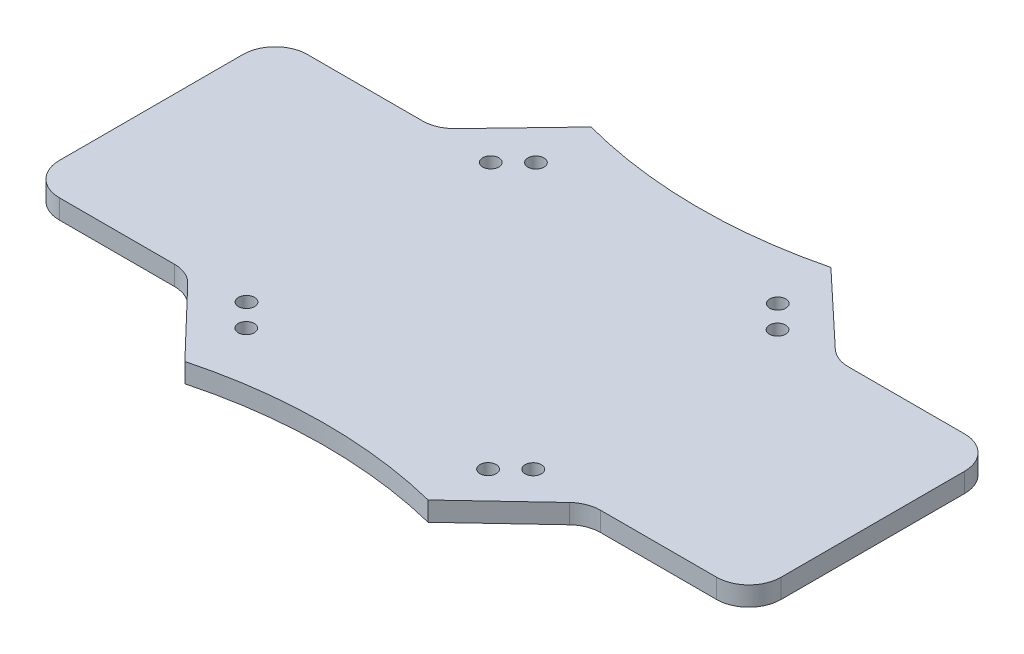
ISO-10303-21;
HEADER;
FILE_DESCRIPTION(('STEP AP214'),'2;1');
FILE_NAME('part.step','',(''),(''),'','','');
FILE_SCHEMA(('AUTOMOTIVE_DESIGN { 1 0 10303 214 1 1 1 1 }'));
ENDSEC;
DATA;
#1=APPLICATION_CONTEXT('core data for automotive mechanical design processes');
#2=APPLICATION_PROTOCOL_DEFINITION('international standard','automotive_design',2000,#1);
#3=PRODUCT_CONTEXT('',#1,'mechanical');
#4=PRODUCT('Part','Part','',(#3));
#5=PRODUCT_RELATED_PRODUCT_CATEGORY('part','',(#4));
#6=PRODUCT_DEFINITION_FORMATION('','',#4);
#7=PRODUCT_DEFINITION_CONTEXT('part definition',#1,'design');
#8=PRODUCT_DEFINITION('design','',#6,#7);
#9=PRODUCT_DEFINITION_SHAPE('','',#8);
#10=(LENGTH_UNIT() NAMED_UNIT(*) SI_UNIT(.MILLI.,.METRE.));
#11=(NAMED_UNIT(*) PLANE_ANGLE_UNIT() SI_UNIT($,.RADIAN.));
#12=(NAMED_UNIT(*) SI_UNIT($,.STERADIAN.) SOLID_ANGLE_UNIT());
#13=UNCERTAINTY_MEASURE_WITH_UNIT(LENGTH_MEASURE(1.E-05),#10,'distance_accuracy_value','');
#14=(GEOMETRIC_REPRESENTATION_CONTEXT(3) GLOBAL_UNCERTAINTY_ASSIGNED_CONTEXT((#13)) GLOBAL_UNIT_ASSIGNED_CONTEXT((#10,
#11,#12)) REPRESENTATION_CONTEXT('',''));
#15=CARTESIAN_POINT('',(0.,0.,0.));
#16=DIRECTION('',(0.,0.,1.));
#17=DIRECTION('',(1.,0.,0.));
#18=AXIS2_PLACEMENT_3D('',#15,#16,#17);
#19=CARTESIAN_POINT('',(-59.0473593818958,3.,-41.581426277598));
#20=DIRECTION('',(-0.722034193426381,0.,-0.6918573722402));
#21=DIRECTION('',(-0.6918573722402,0.,0.722034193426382));
#22=AXIS2_PLACEMENT_3D('',#19,#20,#21);
#23=PLANE('',#22);
#24=DIRECTION('',(0.6918573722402,0.,-0.722034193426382));
#25=VECTOR('',#24,1.);
#26=CARTESIAN_POINT('',(-59.0473593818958,-3.,-41.581426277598));
#27=LINE('',#26,#25);
#28=CARTESIAN_POINT('',(-59.0473593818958,-3.,-41.581426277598));
#29=VERTEX_POINT('',#28);
#30=CARTESIAN_POINT('',(-38.5000000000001,-3.,-63.0250021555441));
#31=VERTEX_POINT('',#30);
#32=EDGE_CURVE('E202',#29,#31,#27,.T.);
#33=ORIENTED_EDGE('',*,*,#32,.F.);
#34=DIRECTION('',(0.,-1.,0.));
#35=VECTOR('',#34,1.);
#36=CARTESIAN_POINT('',(-59.0473593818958,3.,-41.581426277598));
#37=LINE('',#36,#35);
#38=CARTESIAN_POINT('',(-59.0473593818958,3.,-41.581426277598));
#39=VERTEX_POINT('',#38);
#40=EDGE_CURVE('E11',#39,#29,#37,.T.);
#41=ORIENTED_EDGE('',*,*,#40,.F.);
#42=DIRECTION('',(0.6918573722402,0.,-0.722034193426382));
#43=VECTOR('',#42,1.);
#44=CARTESIAN_POINT('',(-59.0473593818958,3.,-41.581426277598));
#45=LINE('',#44,#43);
#46=CARTESIAN_POINT('',(-38.5000000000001,3.,-63.0250021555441));
#47=VERTEX_POINT('',#46);
#48=EDGE_CURVE('E251',#39,#47,#45,.T.);
#49=ORIENTED_EDGE('',*,*,#48,.T.);
#50=DIRECTION('',(0.,-1.,0.));
#51=VECTOR('',#50,1.);
#52=CARTESIAN_POINT('',(-38.5000000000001,3.,-63.0250021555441));
#53=LINE('',#52,#51);
#54=EDGE_CURVE('E36',#47,#31,#53,.T.);
#55=ORIENTED_EDGE('',*,*,#54,.T.);
#56=EDGE_LOOP('',(#33,#41,#49,#55));
#57=FACE_BOUND('',#56,.T.);
#58=ADVANCED_FACE('F33',(#57),#23,.T.);
#59=CARTESIAN_POINT('',(-66.2677013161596,3.,-48.5));
#60=DIRECTION('',(0.,-1.,0.));
#61=DIRECTION('',(0.,0.,-1.));
#62=AXIS2_PLACEMENT_3D('',#59,#60,#61);
#63=CYLINDRICAL_SURFACE('',#62,10.);
#64=CARTESIAN_POINT('',(-66.2677013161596,-3.,-48.5));
#65=DIRECTION('',(0.,1.,0.));
#66=DIRECTION('',(0.,0.,1.));
#67=AXIS2_PLACEMENT_3D('',#64,#65,#66);
#68=CIRCLE('',#67,10.);
#69=CARTESIAN_POINT('',(-66.2677013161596,-3.,-38.5));
#70=VERTEX_POINT('',#69);
#71=EDGE_CURVE('E249',#70,#29,#68,.T.);
#72=ORIENTED_EDGE('',*,*,#71,.F.);
#73=DIRECTION('',(0.,-1.,0.));
#74=VECTOR('',#73,1.);
#75=CARTESIAN_POINT('',(-66.2677013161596,3.,-38.5));
#76=LINE('',#75,#74);
#77=CARTESIAN_POINT('',(-66.2677013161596,3.,-38.5));
#78=VERTEX_POINT('',#77);
#79=EDGE_CURVE('E42',#78,#70,#76,.T.);
#80=ORIENTED_EDGE('',*,*,#79,.F.);
#81=CARTESIAN_POINT('',(-66.2677013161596,3.,-48.5));
#82=DIRECTION('',(0.,1.,0.));
#83=DIRECTION('',(0.,0.,1.));
#84=AXIS2_PLACEMENT_3D('',#81,#82,#83);
#85=CIRCLE('',#84,10.);
#86=EDGE_CURVE('E192',#78,#39,#85,.T.);
#87=ORIENTED_EDGE('',*,*,#86,.T.);
#88=ORIENTED_EDGE('',*,*,#40,.T.);
#89=EDGE_LOOP('',(#72,#80,#87,#88));
#90=FACE_BOUND('',#89,.T.);
#91=ADVANCED_FACE('F295',(#90),#63,.F.);
#92=CARTESIAN_POINT('',(-102.,3.,-38.5));
#93=DIRECTION('',(0.,0.,-1.));
#94=DIRECTION('',(-1.,0.,0.));
#95=AXIS2_PLACEMENT_3D('',#92,#93,#94);
#96=PLANE('',#95);
#97=DIRECTION('',(1.,0.,0.));
#98=VECTOR('',#97,1.);
#99=CARTESIAN_POINT('',(-102.,-3.,-38.5));
#100=LINE('',#99,#98);
#101=CARTESIAN_POINT('',(-102.,-3.,-38.5));
#102=VERTEX_POINT('',#101);
#103=EDGE_CURVE('E179',#102,#70,#100,.T.);
#104=ORIENTED_EDGE('',*,*,#103,.F.);
#105=DIRECTION('',(0.,-1.,0.));
#106=VECTOR('',#105,1.);
#107=CARTESIAN_POINT('',(-102.,3.,-38.5));
#108=LINE('',#107,#106);
#109=CARTESIAN_POINT('',(-102.,3.,-38.5));
#110=VERTEX_POINT('',#109);
#111=EDGE_CURVE('E174',#110,#102,#108,.T.);
#112=ORIENTED_EDGE('',*,*,#111,.F.);
#113=DIRECTION('',(1.,0.,0.));
#114=VECTOR('',#113,1.);
#115=CARTESIAN_POINT('',(-102.,3.,-38.5));
#116=LINE('',#115,#114);
#117=EDGE_CURVE('E177',#110,#78,#116,.T.);
#118=ORIENTED_EDGE('',*,*,#117,.T.);
#119=ORIENTED_EDGE('',*,*,#79,.T.);
#120=EDGE_LOOP('',(#104,#112,#118,#119));
#121=FACE_BOUND('',#120,.T.);
#122=ADVANCED_FACE('F176',(#121),#96,.T.);
#123=CARTESIAN_POINT('',(-102.,3.,-28.5));
#124=DIRECTION('',(0.,-1.,0.));
#125=DIRECTION('',(0.,0.,-1.));
#126=AXIS2_PLACEMENT_3D('',#123,#124,#125);
#127=CYLINDRICAL_SURFACE('',#126,10.);
#128=CARTESIAN_POINT('',(-102.,-3.,-28.5));
#129=DIRECTION('',(0.,-1.,0.));
#130=DIRECTION('',(0.,0.,-1.));
#131=AXIS2_PLACEMENT_3D('',#128,#129,#130);
#132=CIRCLE('',#131,10.);
#133=CARTESIAN_POINT('',(-112.,-3.,-28.4999999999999));
#134=VERTEX_POINT('',#133);
#135=EDGE_CURVE('E246',#134,#102,#132,.T.);
#136=ORIENTED_EDGE('',*,*,#135,.F.);
#137=DIRECTION('',(0.,-1.,0.));
#138=VECTOR('',#137,1.);
#139=CARTESIAN_POINT('',(-112.,3.,-28.4999999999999));
#140=LINE('',#139,#138);
#141=CARTESIAN_POINT('',(-112.,3.,-28.4999999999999));
#142=VERTEX_POINT('',#141);
#143=EDGE_CURVE('E184',#142,#134,#140,.T.);
#144=ORIENTED_EDGE('',*,*,#143,.F.);
#145=CARTESIAN_POINT('',(-102.,3.,-28.5));
#146=DIRECTION('',(0.,-1.,0.));
#147=DIRECTION('',(0.,0.,-1.));
#148=AXIS2_PLACEMENT_3D('',#145,#146,#147);
#149=CIRCLE('',#148,10.);
#150=EDGE_CURVE('E190',#142,#110,#149,.T.);
#151=ORIENTED_EDGE('',*,*,#150,.T.);
#152=ORIENTED_EDGE('',*,*,#111,.T.);
#153=EDGE_LOOP('',(#136,#144,#151,#152));
#154=FACE_BOUND('',#153,.T.);
#155=ADVANCED_FACE('F194',(#154),#127,.T.);
#156=CARTESIAN_POINT('',(-112.,3.,28.4999999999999));
#157=DIRECTION('',(-1.,0.,0.));
#158=DIRECTION('',(0.,0.,1.));
#159=AXIS2_PLACEMENT_3D('',#156,#157,#158);
#160=PLANE('',#159);
#161=DIRECTION('',(0.,0.,-1.));
#162=VECTOR('',#161,1.);
#163=CARTESIAN_POINT('',(-112.,-3.,28.4999999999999));
#164=LINE('',#163,#162);
#165=CARTESIAN_POINT('',(-112.,-3.,28.4999999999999));
#166=VERTEX_POINT('',#165);
#167=EDGE_CURVE('E243',#166,#134,#164,.T.);
#168=ORIENTED_EDGE('',*,*,#167,.F.);
#169=DIRECTION('',(0.,-1.,0.));
#170=VECTOR('',#169,1.);
#171=CARTESIAN_POINT('',(-112.,3.,28.4999999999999));
#172=LINE('',#171,#170);
#173=CARTESIAN_POINT('',(-112.,3.,28.4999999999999));
#174=VERTEX_POINT('',#173);
#175=EDGE_CURVE('E255',#174,#166,#172,.T.);
#176=ORIENTED_EDGE('',*,*,#175,.F.);
#177=DIRECTION('',(0.,0.,-1.));
#178=VECTOR('',#177,1.);
#179=CARTESIAN_POINT('',(-112.,3.,28.4999999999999));
#180=LINE('',#179,#178);
#181=EDGE_CURVE('E195',#174,#142,#180,.T.);
#182=ORIENTED_EDGE('',*,*,#181,.T.);
#183=ORIENTED_EDGE('',*,*,#143,.T.);
#184=EDGE_LOOP('',(#168,#176,#182,#183));
#185=FACE_BOUND('',#184,.T.);
#186=ADVANCED_FACE('F308',(#185),#160,.T.);
#187=CARTESIAN_POINT('',(-102.,3.,28.5));
#188=DIRECTION('',(0.,-1.,0.));
#189=DIRECTION('',(0.,0.,-1.));
#190=AXIS2_PLACEMENT_3D('',#187,#188,#189);
#191=CYLINDRICAL_SURFACE('',#190,10.);
#192=CARTESIAN_POINT('',(-102.,-3.,28.5));
#193=DIRECTION('',(0.,1.,0.));
#194=DIRECTION('',(0.,0.,1.));
#195=AXIS2_PLACEMENT_3D('',#192,#193,#194);
#196=CIRCLE('',#195,10.);
#197=CARTESIAN_POINT('',(-102.,-3.,38.5));
#198=VERTEX_POINT('',#197);
#199=EDGE_CURVE('E241',#166,#198,#196,.T.);
#200=ORIENTED_EDGE('',*,*,#199,.T.);
#201=DIRECTION('',(0.,-1.,0.));
#202=VECTOR('',#201,1.);
#203=CARTESIAN_POINT('',(-102.,3.,38.5));
#204=LINE('',#203,#202);
#205=CARTESIAN_POINT('',(-102.,3.,38.5));
#206=VERTEX_POINT('',#205);
#207=EDGE_CURVE('E257',#206,#198,#204,.T.);
#208=ORIENTED_EDGE('',*,*,#207,.F.);
#209=CARTESIAN_POINT('',(-102.,3.,28.5));
#210=DIRECTION('',(0.,1.,0.));
#211=DIRECTION('',(0.,0.,1.));
#212=AXIS2_PLACEMENT_3D('',#209,#210,#211);
#213=CIRCLE('',#212,10.);
#214=EDGE_CURVE('E197',#174,#206,#213,.T.);
#215=ORIENTED_EDGE('',*,*,#214,.F.);
#216=ORIENTED_EDGE('',*,*,#175,.T.);
#217=EDGE_LOOP('',(#200,#208,#215,#216));
#218=FACE_BOUND('',#217,.T.);
#219=ADVANCED_FACE('F311',(#218),#191,.T.);
#220=CARTESIAN_POINT('',(-102.,3.,38.5));
#221=DIRECTION('',(0.,0.,-1.));
#222=DIRECTION('',(-1.,0.,0.));
#223=AXIS2_PLACEMENT_3D('',#220,#221,#222);
#224=PLANE('',#223);
#225=DIRECTION('',(1.,0.,0.));
#226=VECTOR('',#225,1.);
#227=CARTESIAN_POINT('',(-102.,-3.,38.5));
#228=LINE('',#227,#226);
#229=CARTESIAN_POINT('',(-66.2677013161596,-3.,38.5));
#230=VERTEX_POINT('',#229);
#231=EDGE_CURVE('E239',#198,#230,#228,.T.);
#232=ORIENTED_EDGE('',*,*,#231,.T.);
#233=DIRECTION('',(0.,-1.,0.));
#234=VECTOR('',#233,1.);
#235=CARTESIAN_POINT('',(-66.2677013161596,3.,38.5));
#236=LINE('',#235,#234);
#237=CARTESIAN_POINT('',(-66.2677013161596,3.,38.5));
#238=VERTEX_POINT('',#237);
#239=EDGE_CURVE('E260',#238,#230,#236,.T.);
#240=ORIENTED_EDGE('',*,*,#239,.F.);
#241=DIRECTION('',(1.,0.,0.));
#242=VECTOR('',#241,1.);
#243=CARTESIAN_POINT('',(-102.,3.,38.5));
#244=LINE('',#243,#242);
#245=EDGE_CURVE('E496',#206,#238,#244,.T.);
#246=ORIENTED_EDGE('',*,*,#245,.F.);
#247=ORIENTED_EDGE('',*,*,#207,.T.);
#248=EDGE_LOOP('',(#232,#240,#246,#247));
#249=FACE_BOUND('',#248,.T.);
#250=ADVANCED_FACE('F315',(#249),#224,.F.);
#251=CARTESIAN_POINT('',(-66.2677013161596,3.,48.5));
#252=DIRECTION('',(0.,-1.,0.));
#253=DIRECTION('',(0.,0.,-1.));
#254=AXIS2_PLACEMENT_3D('',#251,#252,#253);
#255=CYLINDRICAL_SURFACE('',#254,10.);
#256=CARTESIAN_POINT('',(-66.2677013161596,-3.,48.5));
#257=DIRECTION('',(0.,-1.,0.));
#258=DIRECTION('',(0.,0.,-1.));
#259=AXIS2_PLACEMENT_3D('',#256,#257,#258);
#260=CIRCLE('',#259,10.);
#261=CARTESIAN_POINT('',(-59.0473593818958,-3.,41.581426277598));
#262=VERTEX_POINT('',#261);
#263=EDGE_CURVE('E237',#230,#262,#260,.T.);
#264=ORIENTED_EDGE('',*,*,#263,.T.);
#265=DIRECTION('',(0.,-1.,0.));
#266=VECTOR('',#265,1.);
#267=CARTESIAN_POINT('',(-59.0473593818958,3.,41.581426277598));
#268=LINE('',#267,#266);
#269=CARTESIAN_POINT('',(-59.0473593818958,3.,41.581426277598));
#270=VERTEX_POINT('',#269);
#271=EDGE_CURVE('E263',#270,#262,#268,.T.);
#272=ORIENTED_EDGE('',*,*,#271,.F.);
#273=CARTESIAN_POINT('',(-66.2677013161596,3.,48.5));
#274=DIRECTION('',(0.,-1.,0.));
#275=DIRECTION('',(0.,0.,-1.));
#276=AXIS2_PLACEMENT_3D('',#273,#274,#275);
#277=CIRCLE('',#276,10.);
#278=EDGE_CURVE('E494',#238,#270,#277,.T.);
#279=ORIENTED_EDGE('',*,*,#278,.F.);
#280=ORIENTED_EDGE('',*,*,#239,.T.);
#281=EDGE_LOOP('',(#264,#272,#279,#280));
#282=FACE_BOUND('',#281,.T.);
#283=ADVANCED_FACE('F319',(#282),#255,.F.);
#284=CARTESIAN_POINT('',(-59.0473593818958,3.,41.581426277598));
#285=DIRECTION('',(0.722034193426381,0.,-0.6918573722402));
#286=DIRECTION('',(-0.6918573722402,0.,-0.722034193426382));
#287=AXIS2_PLACEMENT_3D('',#284,#285,#286);
#288=PLANE('',#287);
#289=DIRECTION('',(0.6918573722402,0.,0.722034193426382));
#290=VECTOR('',#289,1.);
#291=CARTESIAN_POINT('',(-59.0473593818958,-3.,41.581426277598));
#292=LINE('',#291,#290);
#293=CARTESIAN_POINT('',(-38.5000000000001,-3.,63.0250021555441));
#294=VERTEX_POINT('',#293);
#295=EDGE_CURVE('E235',#262,#294,#292,.T.);
#296=ORIENTED_EDGE('',*,*,#295,.T.);
#297=DIRECTION('',(0.,-1.,0.));
#298=VECTOR('',#297,1.);
#299=CARTESIAN_POINT('',(-38.5000000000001,3.,63.0250021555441));
#300=LINE('',#299,#298);
#301=CARTESIAN_POINT('',(-38.5000000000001,3.,63.0250021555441));
#302=VERTEX_POINT('',#301);
#303=EDGE_CURVE('E266',#302,#294,#300,.T.);
#304=ORIENTED_EDGE('',*,*,#303,.F.);
#305=DIRECTION('',(0.6918573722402,0.,0.722034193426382));
#306=VECTOR('',#305,1.);
#307=CARTESIAN_POINT('',(-59.0473593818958,3.,41.581426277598));
#308=LINE('',#307,#306);
#309=EDGE_CURVE('E492',#270,#302,#308,.T.);
#310=ORIENTED_EDGE('',*,*,#309,.F.);
#311=ORIENTED_EDGE('',*,*,#271,.T.);
#312=EDGE_LOOP('',(#296,#304,#310,#311));
#313=FACE_BOUND('',#312,.T.);
#314=ADVANCED_FACE('F323',(#313),#288,.F.);
#315=CARTESIAN_POINT('',(0.,3.,208.));
#316=DIRECTION('',(0.,-1.,0.));
#317=DIRECTION('',(0.,0.,-1.));
#318=AXIS2_PLACEMENT_3D('',#315,#316,#317);
#319=CYLINDRICAL_SURFACE('',#318,150.);
#320=CARTESIAN_POINT('',(0.,-3.,208.));
#321=DIRECTION('',(0.,-1.,0.));
#322=DIRECTION('',(0.,0.,-1.));
#323=AXIS2_PLACEMENT_3D('',#320,#321,#322);
#324=CIRCLE('',#323,150.);
#325=CARTESIAN_POINT('',(36.4657373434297,-3.,62.5));
#326=VERTEX_POINT('',#325);
#327=EDGE_CURVE('E233',#294,#326,#324,.T.);
#328=ORIENTED_EDGE('',*,*,#327,.T.);
#329=DIRECTION('',(0.,-1.,0.));
#330=VECTOR('',#329,1.);
#331=CARTESIAN_POINT('',(36.4657373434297,3.,62.5));
#332=LINE('',#331,#330);
#333=CARTESIAN_POINT('',(36.4657373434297,3.,62.5));
#334=VERTEX_POINT('',#333);
#335=EDGE_CURVE('E269',#334,#326,#332,.T.);
#336=ORIENTED_EDGE('',*,*,#335,.F.);
#337=CARTESIAN_POINT('',(0.,3.,208.));
#338=DIRECTION('',(0.,-1.,0.));
#339=DIRECTION('',(0.,0.,-1.));
#340=AXIS2_PLACEMENT_3D('',#337,#338,#339);
#341=CIRCLE('',#340,150.);
#342=EDGE_CURVE('E490',#302,#334,#341,.T.);
#343=ORIENTED_EDGE('',*,*,#342,.F.);
#344=ORIENTED_EDGE('',*,*,#303,.T.);
#345=EDGE_LOOP('',(#328,#336,#343,#344));
#346=FACE_BOUND('',#345,.T.);
#347=ADVANCED_FACE('F327',(#346),#319,.F.);
#348=CARTESIAN_POINT('',(36.4657373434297,3.,62.5));
#349=DIRECTION('',(-0.684876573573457,0.,-0.728659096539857));
#350=DIRECTION('',(-0.728659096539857,0.,0.684876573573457));
#351=AXIS2_PLACEMENT_3D('',#348,#349,#350);
#352=PLANE('',#351);
#353=DIRECTION('',(0.728659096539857,0.,-0.684876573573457));
#354=VECTOR('',#353,1.);
#355=CARTESIAN_POINT('',(36.4657373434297,-3.,62.5));
#356=LINE('',#355,#354);
#357=CARTESIAN_POINT('',(59.1131292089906,-3.,41.2134090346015));
#358=VERTEX_POINT('',#357);
#359=EDGE_CURVE('E231',#326,#358,#356,.T.);
#360=ORIENTED_EDGE('',*,*,#359,.T.);
#361=DIRECTION('',(0.,-1.,0.));
#362=VECTOR('',#361,1.);
#363=CARTESIAN_POINT('',(59.1131292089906,3.,41.2134090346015));
#364=LINE('',#363,#362);
#365=CARTESIAN_POINT('',(59.1131292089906,3.,41.2134090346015));
#366=VERTEX_POINT('',#365);
#367=EDGE_CURVE('E272',#366,#358,#364,.T.);
#368=ORIENTED_EDGE('',*,*,#367,.F.);
#369=DIRECTION('',(0.728659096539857,0.,-0.684876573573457));
#370=VECTOR('',#369,1.);
#371=CARTESIAN_POINT('',(36.4657373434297,3.,62.5));
#372=LINE('',#371,#370);
#373=EDGE_CURVE('E488',#334,#366,#372,.T.);
#374=ORIENTED_EDGE('',*,*,#373,.F.);
#375=ORIENTED_EDGE('',*,*,#335,.T.);
#376=EDGE_LOOP('',(#360,#368,#374,#375));
#377=FACE_BOUND('',#376,.T.);
#378=ADVANCED_FACE('F331',(#377),#352,.F.);
#379=CARTESIAN_POINT('',(65.9618949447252,3.,48.5));
#380=DIRECTION('',(0.,-1.,0.));
#381=DIRECTION('',(0.,0.,-1.));
#382=AXIS2_PLACEMENT_3D('',#379,#380,#381);
#383=CYLINDRICAL_SURFACE('',#382,10.);
#384=CARTESIAN_POINT('',(65.9618949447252,-3.,48.5));
#385=DIRECTION('',(0.,-1.,0.));
#386=DIRECTION('',(0.,0.,-1.));
#387=AXIS2_PLACEMENT_3D('',#384,#385,#386);
#388=CIRCLE('',#387,10.);
#389=CARTESIAN_POINT('',(65.9618949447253,-3.,38.5));
#390=VERTEX_POINT('',#389);
#391=EDGE_CURVE('E229',#358,#390,#388,.T.);
#392=ORIENTED_EDGE('',*,*,#391,.T.);
#393=DIRECTION('',(0.,-1.,0.));
#394=VECTOR('',#393,1.);
#395=CARTESIAN_POINT('',(65.9618949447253,3.,38.5));
#396=LINE('',#395,#394);
#397=CARTESIAN_POINT('',(65.9618949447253,3.,38.5));
#398=VERTEX_POINT('',#397);
#399=EDGE_CURVE('E275',#398,#390,#396,.T.);
#400=ORIENTED_EDGE('',*,*,#399,.F.);
#401=CARTESIAN_POINT('',(65.9618949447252,3.,48.5));
#402=DIRECTION('',(0.,-1.,0.));
#403=DIRECTION('',(0.,0.,-1.));
#404=AXIS2_PLACEMENT_3D('',#401,#402,#403);
#405=CIRCLE('',#404,10.);
#406=EDGE_CURVE('E486',#366,#398,#405,.T.);
#407=ORIENTED_EDGE('',*,*,#406,.F.);
#408=ORIENTED_EDGE('',*,*,#367,.T.);
#409=EDGE_LOOP('',(#392,#400,#407,#408));
#410=FACE_BOUND('',#409,.T.);
#411=ADVANCED_FACE('F335',(#410),#383,.F.);
#412=CARTESIAN_POINT('',(65.9618949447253,3.,38.5));
#413=DIRECTION('',(0.,0.,-1.));
#414=DIRECTION('',(-1.,0.,0.));
#415=AXIS2_PLACEMENT_3D('',#412,#413,#414);
#416=PLANE('',#415);
#417=DIRECTION('',(1.,0.,0.));
#418=VECTOR('',#417,1.);
#419=CARTESIAN_POINT('',(65.9618949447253,-3.,38.5));
#420=LINE('',#419,#418);
#421=CARTESIAN_POINT('',(102.,-3.,38.5));
#422=VERTEX_POINT('',#421);
#423=EDGE_CURVE('E227',#390,#422,#420,.T.);
#424=ORIENTED_EDGE('',*,*,#423,.T.);
#425=DIRECTION('',(0.,-1.,0.));
#426=VECTOR('',#425,1.);
#427=CARTESIAN_POINT('',(102.,3.,38.5));
#428=LINE('',#427,#426);
#429=CARTESIAN_POINT('',(102.,3.,38.5));
#430=VERTEX_POINT('',#429);
#431=EDGE_CURVE('E278',#430,#422,#428,.T.);
#432=ORIENTED_EDGE('',*,*,#431,.F.);
#433=DIRECTION('',(1.,0.,0.));
#434=VECTOR('',#433,1.);
#435=CARTESIAN_POINT('',(65.9618949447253,3.,38.5));
#436=LINE('',#435,#434);
#437=EDGE_CURVE('E484',#398,#430,#436,.T.);
#438=ORIENTED_EDGE('',*,*,#437,.F.);
#439=ORIENTED_EDGE('',*,*,#399,.T.);
#440=EDGE_LOOP('',(#424,#432,#438,#439));
#441=FACE_BOUND('',#440,.T.);
#442=ADVANCED_FACE('F339',(#441),#416,.F.);
#443=CARTESIAN_POINT('',(102.,3.,28.5));
#444=DIRECTION('',(0.,-1.,0.));
#445=DIRECTION('',(0.,0.,-1.));
#446=AXIS2_PLACEMENT_3D('',#443,#444,#445);
#447=CYLINDRICAL_SURFACE('',#446,10.);
#448=CARTESIAN_POINT('',(102.,-3.,28.5));
#449=DIRECTION('',(0.,1.,0.));
#450=DIRECTION('',(0.,0.,1.));
#451=AXIS2_PLACEMENT_3D('',#448,#449,#450);
#452=CIRCLE('',#451,10.);
#453=CARTESIAN_POINT('',(112.,-3.,28.4999999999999));
#454=VERTEX_POINT('',#453);
#455=EDGE_CURVE('E224',#422,#454,#452,.T.);
#456=ORIENTED_EDGE('',*,*,#455,.T.);
#457=DIRECTION('',(0.,-1.,0.));
#458=VECTOR('',#457,1.);
#459=CARTESIAN_POINT('',(112.,3.,28.4999999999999));
#460=LINE('',#459,#458);
#461=CARTESIAN_POINT('',(112.,3.,28.4999999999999));
#462=VERTEX_POINT('',#461);
#463=EDGE_CURVE('E281',#462,#454,#460,.T.);
#464=ORIENTED_EDGE('',*,*,#463,.F.);
#465=CARTESIAN_POINT('',(102.,3.,28.5));
#466=DIRECTION('',(0.,1.,0.));
#467=DIRECTION('',(0.,0.,1.));
#468=AXIS2_PLACEMENT_3D('',#465,#466,#467);
#469=CIRCLE('',#468,10.);
#470=EDGE_CURVE('E482',#430,#462,#469,.T.);
#471=ORIENTED_EDGE('',*,*,#470,.F.);
#472=ORIENTED_EDGE('',*,*,#431,.T.);
#473=EDGE_LOOP('',(#456,#464,#471,#472));
#474=FACE_BOUND('',#473,.T.);
#475=ADVANCED_FACE('F343',(#474),#447,.T.);
#476=CARTESIAN_POINT('',(112.,3.,-28.4999999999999));
#477=DIRECTION('',(1.,0.,0.));
#478=DIRECTION('',(0.,0.,-1.));
#479=AXIS2_PLACEMENT_3D('',#476,#477,#478);
#480=PLANE('',#479);
#481=DIRECTION('',(0.,0.,1.));
#482=VECTOR('',#481,1.);
#483=CARTESIAN_POINT('',(112.,-3.,-28.4999999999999));
#484=LINE('',#483,#482);
#485=CARTESIAN_POINT('',(112.,-3.,-28.4999999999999));
#486=VERTEX_POINT('',#485);
#487=EDGE_CURVE('E221',#486,#454,#484,.T.);
#488=ORIENTED_EDGE('',*,*,#487,.F.);
#489=DIRECTION('',(0.,-1.,0.));
#490=VECTOR('',#489,1.);
#491=CARTESIAN_POINT('',(112.,3.,-28.4999999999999));
#492=LINE('',#491,#490);
#493=CARTESIAN_POINT('',(112.,3.,-28.4999999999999));
#494=VERTEX_POINT('',#493);
#495=EDGE_CURVE('E283',#494,#486,#492,.T.);
#496=ORIENTED_EDGE('',*,*,#495,.F.);
#497=DIRECTION('',(0.,0.,1.));
#498=VECTOR('',#497,1.);
#499=CARTESIAN_POINT('',(112.,3.,-28.4999999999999));
#500=LINE('',#499,#498);
#501=EDGE_CURVE('E479',#494,#462,#500,.T.);
#502=ORIENTED_EDGE('',*,*,#501,.T.);
#503=ORIENTED_EDGE('',*,*,#463,.T.);
#504=EDGE_LOOP('',(#488,#496,#502,#503));
#505=FACE_BOUND('',#504,.T.);
#506=ADVANCED_FACE('F347',(#505),#480,.T.);
#507=CARTESIAN_POINT('',(102.,3.,-28.5));
#508=DIRECTION('',(0.,-1.,0.));
#509=DIRECTION('',(0.,0.,-1.));
#510=AXIS2_PLACEMENT_3D('',#507,#508,#509);
#511=CYLINDRICAL_SURFACE('',#510,10.);
#512=CARTESIAN_POINT('',(102.,-3.,-28.5));
#513=DIRECTION('',(0.,-1.,0.));
#514=DIRECTION('',(0.,0.,-1.));
#515=AXIS2_PLACEMENT_3D('',#512,#513,#514);
#516=CIRCLE('',#515,10.);
#517=CARTESIAN_POINT('',(102.,-3.,-38.5));
#518=VERTEX_POINT('',#517);
#519=EDGE_CURVE('E218',#518,#486,#516,.T.);
#520=ORIENTED_EDGE('',*,*,#519,.F.);
#521=DIRECTION('',(0.,-1.,0.));
#522=VECTOR('',#521,1.);
#523=CARTESIAN_POINT('',(102.,3.,-38.5));
#524=LINE('',#523,#522);
#525=CARTESIAN_POINT('',(102.,3.,-38.5));
#526=VERTEX_POINT('',#525);
#527=EDGE_CURVE('E285',#526,#518,#524,.T.);
#528=ORIENTED_EDGE('',*,*,#527,.F.);
#529=CARTESIAN_POINT('',(102.,3.,-28.5));
#530=DIRECTION('',(0.,-1.,0.));
#531=DIRECTION('',(0.,0.,-1.));
#532=AXIS2_PLACEMENT_3D('',#529,#530,#531);
#533=CIRCLE('',#532,10.);
#534=EDGE_CURVE('E476',#526,#494,#533,.T.);
#535=ORIENTED_EDGE('',*,*,#534,.T.);
#536=ORIENTED_EDGE('',*,*,#495,.T.);
#537=EDGE_LOOP('',(#520,#528,#535,#536));
#538=FACE_BOUND('',#537,.T.);
#539=ADVANCED_FACE('F351',(#538),#511,.T.);
#540=CARTESIAN_POINT('',(65.9618949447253,3.,-38.5));
#541=DIRECTION('',(0.,0.,-1.));
#542=DIRECTION('',(-1.,0.,0.));
#543=AXIS2_PLACEMENT_3D('',#540,#541,#542);
#544=PLANE('',#543);
#545=DIRECTION('',(1.,0.,0.));
#546=VECTOR('',#545,1.);
#547=CARTESIAN_POINT('',(65.9618949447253,-3.,-38.5));
#548=LINE('',#547,#546);
#549=CARTESIAN_POINT('',(65.9618949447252,-3.,-38.5));
#550=VERTEX_POINT('',#549);
#551=EDGE_CURVE('E215',#550,#518,#548,.T.);
#552=ORIENTED_EDGE('',*,*,#551,.F.);
#553=DIRECTION('',(0.,-1.,0.));
#554=VECTOR('',#553,1.);
#555=CARTESIAN_POINT('',(65.9618949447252,3.,-38.5));
#556=LINE('',#555,#554);
#557=CARTESIAN_POINT('',(65.9618949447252,3.,-38.5));
#558=VERTEX_POINT('',#557);
#559=EDGE_CURVE('E287',#558,#550,#556,.T.);
#560=ORIENTED_EDGE('',*,*,#559,.F.);
#561=DIRECTION('',(1.,0.,0.));
#562=VECTOR('',#561,1.);
#563=CARTESIAN_POINT('',(65.9618949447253,3.,-38.5));
#564=LINE('',#563,#562);
#565=EDGE_CURVE('E473',#558,#526,#564,.T.);
#566=ORIENTED_EDGE('',*,*,#565,.T.);
#567=ORIENTED_EDGE('',*,*,#527,.T.);
#568=EDGE_LOOP('',(#552,#560,#566,#567));
#569=FACE_BOUND('',#568,.T.);
#570=ADVANCED_FACE('F355',(#569),#544,.T.);
#571=CARTESIAN_POINT('',(65.9618949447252,3.,-48.5));
#572=DIRECTION('',(0.,-1.,0.));
#573=DIRECTION('',(0.,0.,-1.));
#574=AXIS2_PLACEMENT_3D('',#571,#572,#573);
#575=CYLINDRICAL_SURFACE('',#574,10.);
#576=CARTESIAN_POINT('',(65.9618949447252,-3.,-48.5));
#577=DIRECTION('',(0.,1.,0.));
#578=DIRECTION('',(0.,0.,1.));
#579=AXIS2_PLACEMENT_3D('',#576,#577,#578);
#580=CIRCLE('',#579,10.);
#581=CARTESIAN_POINT('',(59.1131292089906,-3.,-41.2134090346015));
#582=VERTEX_POINT('',#581);
#583=EDGE_CURVE('E212',#582,#550,#580,.T.);
#584=ORIENTED_EDGE('',*,*,#583,.F.);
#585=DIRECTION('',(0.,-1.,0.));
#586=VECTOR('',#585,1.);
#587=CARTESIAN_POINT('',(59.1131292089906,3.,-41.2134090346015));
#588=LINE('',#587,#586);
#589=CARTESIAN_POINT('',(59.1131292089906,3.,-41.2134090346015));
#590=VERTEX_POINT('',#589);
#591=EDGE_CURVE('E289',#590,#582,#588,.T.);
#592=ORIENTED_EDGE('',*,*,#591,.F.);
#593=CARTESIAN_POINT('',(65.9618949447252,3.,-48.5));
#594=DIRECTION('',(0.,1.,0.));
#595=DIRECTION('',(0.,0.,1.));
#596=AXIS2_PLACEMENT_3D('',#593,#594,#595);
#597=CIRCLE('',#596,10.);
#598=EDGE_CURVE('E470',#590,#558,#597,.T.);
#599=ORIENTED_EDGE('',*,*,#598,.T.);
#600=ORIENTED_EDGE('',*,*,#559,.T.);
#601=EDGE_LOOP('',(#584,#592,#599,#600));
#602=FACE_BOUND('',#601,.T.);
#603=ADVANCED_FACE('F359',(#602),#575,.F.);
#604=CARTESIAN_POINT('',(36.4657373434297,3.,-62.5));
#605=DIRECTION('',(0.684876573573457,0.,-0.728659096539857));
#606=DIRECTION('',(-0.728659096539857,0.,-0.684876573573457));
#607=AXIS2_PLACEMENT_3D('',#604,#605,#606);
#608=PLANE('',#607);
#609=DIRECTION('',(0.728659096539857,0.,0.684876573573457));
#610=VECTOR('',#609,1.);
#611=CARTESIAN_POINT('',(36.4657373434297,-3.,-62.5));
#612=LINE('',#611,#610);
#613=CARTESIAN_POINT('',(36.4657373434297,-3.,-62.5));
#614=VERTEX_POINT('',#613);
#615=EDGE_CURVE('E209',#614,#582,#612,.T.);
#616=ORIENTED_EDGE('',*,*,#615,.F.);
#617=DIRECTION('',(0.,-1.,0.));
#618=VECTOR('',#617,1.);
#619=CARTESIAN_POINT('',(36.4657373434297,3.,-62.5));
#620=LINE('',#619,#618);
#621=CARTESIAN_POINT('',(36.4657373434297,3.,-62.5));
#622=VERTEX_POINT('',#621);
#623=EDGE_CURVE('E290',#622,#614,#620,.T.);
#624=ORIENTED_EDGE('',*,*,#623,.F.);
#625=DIRECTION('',(0.728659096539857,0.,0.684876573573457));
#626=VECTOR('',#625,1.);
#627=CARTESIAN_POINT('',(36.4657373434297,3.,-62.5));
#628=LINE('',#627,#626);
#629=EDGE_CURVE('E467',#622,#590,#628,.T.);
#630=ORIENTED_EDGE('',*,*,#629,.T.);
#631=ORIENTED_EDGE('',*,*,#591,.T.);
#632=EDGE_LOOP('',(#616,#624,#630,#631));
#633=FACE_BOUND('',#632,.T.);
#634=ADVANCED_FACE('F363',(#633),#608,.T.);
#635=CARTESIAN_POINT('',(0.,3.,-208.));
#636=DIRECTION('',(0.,-1.,0.));
#637=DIRECTION('',(0.,0.,-1.));
#638=AXIS2_PLACEMENT_3D('',#635,#636,#637);
#639=CYLINDRICAL_SURFACE('',#638,150.);
#640=CARTESIAN_POINT('',(0.,-3.,-208.));
#641=DIRECTION('',(0.,1.,0.));
#642=DIRECTION('',(0.,0.,1.));
#643=AXIS2_PLACEMENT_3D('',#640,#641,#642);
#644=CIRCLE('',#643,150.);
#645=EDGE_CURVE('E205',#31,#614,#644,.T.);
#646=ORIENTED_EDGE('',*,*,#645,.F.);
#647=ORIENTED_EDGE('',*,*,#54,.F.);
#648=CARTESIAN_POINT('',(0.,3.,-208.));
#649=DIRECTION('',(0.,1.,0.));
#650=DIRECTION('',(0.,0.,1.));
#651=AXIS2_PLACEMENT_3D('',#648,#649,#650);
#652=CIRCLE('',#651,150.);
#653=EDGE_CURVE('E465',#47,#622,#652,.T.);
#654=ORIENTED_EDGE('',*,*,#653,.T.);
#655=ORIENTED_EDGE('',*,*,#623,.T.);
#656=EDGE_LOOP('',(#646,#647,#654,#655));
#657=FACE_BOUND('',#656,.T.);
#658=ADVANCED_FACE('F292',(#657),#639,.F.);
#659=CARTESIAN_POINT('',(0.,3.,-208.));
#660=DIRECTION('',(0.,1.,0.));
#661=DIRECTION('',(0.,0.,1.));
#662=AXIS2_PLACEMENT_3D('',#659,#660,#661);
#663=PLANE('',#662);
#664=CARTESIAN_POINT('',(44.5324718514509,3.,37.9403282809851));
#665=DIRECTION('',(0.,1.,0.));
#666=DIRECTION('',(-1.,0.,0.));
#667=AXIS2_PLACEMENT_3D('',#664,#665,#666);
#668=CIRCLE('',#667,2.5);
#669=CARTESIAN_POINT('',(42.0324718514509,3.,37.9403282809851));
#670=VERTEX_POINT('',#669);
#671=EDGE_CURVE('E421',#670,#670,#668,.T.);
#672=ORIENTED_EDGE('',*,*,#671,.F.);
#673=EDGE_LOOP('',(#672));
#674=FACE_BOUND('',#673,.T.);
#675=CARTESIAN_POINT('',(-44.9142501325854,3.,37.4875938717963));
#676=DIRECTION('',(0.,1.,0.));
#677=DIRECTION('',(0.,0.,-1.));
#678=AXIS2_PLACEMENT_3D('',#675,#676,#677);
#679=CIRCLE('',#678,2.5);
#680=CARTESIAN_POINT('',(-44.9142501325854,3.,34.9875938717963));
#681=VERTEX_POINT('',#680);
#682=EDGE_CURVE('E428',#681,#681,#679,.T.);
#683=ORIENTED_EDGE('',*,*,#682,.F.);
#684=EDGE_LOOP('',(#683));
#685=FACE_BOUND('',#684,.T.);
#686=CARTESIAN_POINT('',(-37.9403282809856,3.,44.5324718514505));
#687=DIRECTION('',(0.,1.,0.));
#688=DIRECTION('',(0.,0.,-1.));
#689=AXIS2_PLACEMENT_3D('',#686,#687,#688);
#690=CIRCLE('',#689,2.5);
#691=CARTESIAN_POINT('',(-37.9403282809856,3.,42.0324718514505));
#692=VERTEX_POINT('',#691);
#693=EDGE_CURVE('E427',#692,#692,#690,.T.);
#694=ORIENTED_EDGE('',*,*,#693,.F.);
#695=EDGE_LOOP('',(#694));
#696=FACE_BOUND('',#695,.T.);
#697=CARTESIAN_POINT('',(-37.4875938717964,3.,-44.9142501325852));
#698=DIRECTION('',(0.,1.,0.));
#699=DIRECTION('',(1.,0.,0.));
#700=AXIS2_PLACEMENT_3D('',#697,#698,#699);
#701=CIRCLE('',#700,2.5);
#702=CARTESIAN_POINT('',(-34.9875938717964,3.,-44.9142501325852));
#703=VERTEX_POINT('',#702);
#704=EDGE_CURVE('E440',#703,#703,#701,.T.);
#705=ORIENTED_EDGE('',*,*,#704,.F.);
#706=EDGE_LOOP('',(#705));
#707=FACE_BOUND('',#706,.T.);
#708=CARTESIAN_POINT('',(37.4875938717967,3.,44.914250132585));
#709=DIRECTION('',(0.,1.,0.));
#710=DIRECTION('',(-1.,0.,0.));
#711=AXIS2_PLACEMENT_3D('',#708,#709,#710);
#712=CIRCLE('',#711,2.5);
#713=CARTESIAN_POINT('',(34.9875938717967,3.,44.914250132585));
#714=VERTEX_POINT('',#713);
#715=EDGE_CURVE('E418',#714,#714,#712,.T.);
#716=ORIENTED_EDGE('',*,*,#715,.F.);
#717=EDGE_LOOP('',(#716));
#718=FACE_BOUND('',#717,.T.);
#719=CARTESIAN_POINT('',(-44.5324718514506,3.,-37.9403282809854));
#720=DIRECTION('',(0.,1.,0.));
#721=DIRECTION('',(1.,0.,0.));
#722=AXIS2_PLACEMENT_3D('',#719,#720,#721);
#723=CIRCLE('',#722,2.5);
#724=CARTESIAN_POINT('',(-42.0324718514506,3.,-37.9403282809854));
#725=VERTEX_POINT('',#724);
#726=EDGE_CURVE('E439',#725,#725,#723,.T.);
#727=ORIENTED_EDGE('',*,*,#726,.F.);
#728=EDGE_LOOP('',(#727));
#729=FACE_BOUND('',#728,.T.);
#730=CARTESIAN_POINT('',(37.9403282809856,3.,-44.5324718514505));
#731=DIRECTION('',(0.,1.,0.));
#732=DIRECTION('',(0.,0.,1.));
#733=AXIS2_PLACEMENT_3D('',#730,#731,#732);
#734=CIRCLE('',#733,2.5);
#735=CARTESIAN_POINT('',(37.9403282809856,3.,-42.0324718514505));
#736=VERTEX_POINT('',#735);
#737=EDGE_CURVE('E456',#736,#736,#734,.T.);
#738=ORIENTED_EDGE('',*,*,#737,.F.);
#739=EDGE_LOOP('',(#738));
#740=FACE_BOUND('',#739,.T.);
#741=CARTESIAN_POINT('',(44.9142501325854,3.,-37.4875938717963));
#742=DIRECTION('',(0.,1.,0.));
#743=DIRECTION('',(0.,0.,1.));
#744=AXIS2_PLACEMENT_3D('',#741,#742,#743);
#745=CIRCLE('',#744,2.5);
#746=CARTESIAN_POINT('',(44.9142501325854,3.,-34.9875938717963));
#747=VERTEX_POINT('',#746);
#748=EDGE_CURVE('E451',#747,#747,#745,.T.);
#749=ORIENTED_EDGE('',*,*,#748,.F.);
#750=EDGE_LOOP('',(#749));
#751=FACE_BOUND('',#750,.T.);
#752=ORIENTED_EDGE('',*,*,#48,.F.);
#753=ORIENTED_EDGE('',*,*,#86,.F.);
#754=ORIENTED_EDGE('',*,*,#117,.F.);
#755=ORIENTED_EDGE('',*,*,#150,.F.);
#756=ORIENTED_EDGE('',*,*,#181,.F.);
#757=ORIENTED_EDGE('',*,*,#214,.T.);
#758=ORIENTED_EDGE('',*,*,#245,.T.);
#759=ORIENTED_EDGE('',*,*,#278,.T.);
#760=ORIENTED_EDGE('',*,*,#309,.T.);
#761=ORIENTED_EDGE('',*,*,#342,.T.);
#762=ORIENTED_EDGE('',*,*,#373,.T.);
#763=ORIENTED_EDGE('',*,*,#406,.T.);
#764=ORIENTED_EDGE('',*,*,#437,.T.);
#765=ORIENTED_EDGE('',*,*,#470,.T.);
#766=ORIENTED_EDGE('',*,*,#501,.F.);
#767=ORIENTED_EDGE('',*,*,#534,.F.);
#768=ORIENTED_EDGE('',*,*,#565,.F.);
#769=ORIENTED_EDGE('',*,*,#598,.F.);
#770=ORIENTED_EDGE('',*,*,#629,.F.);
#771=ORIENTED_EDGE('',*,*,#653,.F.);
#772=EDGE_LOOP('',(#752,#753,#754,#755,#756,#757,#758,#759,#760,#761,#762,#763,#764,#765,#766,
#767,#768,#769,#770,#771));
#773=FACE_BOUND('',#772,.T.);
#774=ADVANCED_FACE('F188',(#674,#685,#696,#707,#718,#729,#740,#751,#773),#663,.T.);
#775=CARTESIAN_POINT('',(0.,-3.,-208.));
#776=DIRECTION('',(0.,1.,0.));
#777=DIRECTION('',(0.,0.,1.));
#778=AXIS2_PLACEMENT_3D('',#775,#776,#777);
#779=PLANE('',#778);
#780=CARTESIAN_POINT('',(44.5324718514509,-3.,37.9403282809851));
#781=DIRECTION('',(0.,1.,0.));
#782=DIRECTION('',(-1.,0.,0.));
#783=AXIS2_PLACEMENT_3D('',#780,#781,#782);
#784=CIRCLE('',#783,2.5);
#785=CARTESIAN_POINT('',(42.0324718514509,-3.,37.9403282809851));
#786=VERTEX_POINT('',#785);
#787=EDGE_CURVE('E431',#786,#786,#784,.T.);
#788=ORIENTED_EDGE('',*,*,#787,.T.);
#789=EDGE_LOOP('',(#788));
#790=FACE_BOUND('',#789,.T.);
#791=CARTESIAN_POINT('',(-44.9142501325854,-3.,37.4875938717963));
#792=DIRECTION('',(0.,1.,0.));
#793=DIRECTION('',(0.,0.,-1.));
#794=AXIS2_PLACEMENT_3D('',#791,#792,#793);
#795=CIRCLE('',#794,2.5);
#796=CARTESIAN_POINT('',(-44.9142501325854,-3.,34.9875938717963));
#797=VERTEX_POINT('',#796);
#798=EDGE_CURVE('E424',#797,#797,#795,.T.);
#799=ORIENTED_EDGE('',*,*,#798,.T.);
#800=EDGE_LOOP('',(#799));
#801=FACE_BOUND('',#800,.T.);
#802=CARTESIAN_POINT('',(-37.9403282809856,-3.,44.5324718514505));
#803=DIRECTION('',(0.,1.,0.));
#804=DIRECTION('',(0.,0.,-1.));
#805=AXIS2_PLACEMENT_3D('',#802,#803,#804);
#806=CIRCLE('',#805,2.5);
#807=CARTESIAN_POINT('',(-37.9403282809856,-3.,42.0324718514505));
#808=VERTEX_POINT('',#807);
#809=EDGE_CURVE('E443',#808,#808,#806,.T.);
#810=ORIENTED_EDGE('',*,*,#809,.T.);
#811=EDGE_LOOP('',(#810));
#812=FACE_BOUND('',#811,.T.);
#813=CARTESIAN_POINT('',(-37.4875938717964,-3.,-44.9142501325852));
#814=DIRECTION('',(0.,1.,0.));
#815=DIRECTION('',(1.,0.,0.));
#816=AXIS2_PLACEMENT_3D('',#813,#814,#815);
#817=CIRCLE('',#816,2.5);
#818=CARTESIAN_POINT('',(-34.9875938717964,-3.,-44.9142501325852));
#819=VERTEX_POINT('',#818);
#820=EDGE_CURVE('E436',#819,#819,#817,.T.);
#821=ORIENTED_EDGE('',*,*,#820,.T.);
#822=EDGE_LOOP('',(#821));
#823=FACE_BOUND('',#822,.T.);
#824=CARTESIAN_POINT('',(37.4875938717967,-3.,44.914250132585));
#825=DIRECTION('',(0.,1.,0.));
#826=DIRECTION('',(-1.,0.,0.));
#827=AXIS2_PLACEMENT_3D('',#824,#825,#826);
#828=CIRCLE('',#827,2.5);
#829=CARTESIAN_POINT('',(34.9875938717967,-3.,44.914250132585));
#830=VERTEX_POINT('',#829);
#831=EDGE_CURVE('E415',#830,#830,#828,.T.);
#832=ORIENTED_EDGE('',*,*,#831,.T.);
#833=EDGE_LOOP('',(#832));
#834=FACE_BOUND('',#833,.T.);
#835=CARTESIAN_POINT('',(-44.5324718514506,-3.,-37.9403282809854));
#836=DIRECTION('',(0.,1.,0.));
#837=DIRECTION('',(1.,0.,0.));
#838=AXIS2_PLACEMENT_3D('',#835,#836,#837);
#839=CIRCLE('',#838,2.5);
#840=CARTESIAN_POINT('',(-42.0324718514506,-3.,-37.9403282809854));
#841=VERTEX_POINT('',#840);
#842=EDGE_CURVE('E448',#841,#841,#839,.T.);
#843=ORIENTED_EDGE('',*,*,#842,.T.);
#844=EDGE_LOOP('',(#843));
#845=FACE_BOUND('',#844,.T.);
#846=CARTESIAN_POINT('',(37.9403282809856,-3.,-44.5324718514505));
#847=DIRECTION('',(0.,1.,0.));
#848=DIRECTION('',(0.,0.,1.));
#849=AXIS2_PLACEMENT_3D('',#846,#847,#848);
#850=CIRCLE('',#849,2.5);
#851=CARTESIAN_POINT('',(37.9403282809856,-3.,-42.0324718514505));
#852=VERTEX_POINT('',#851);
#853=EDGE_CURVE('E206',#852,#852,#850,.T.);
#854=ORIENTED_EDGE('',*,*,#853,.T.);
#855=EDGE_LOOP('',(#854));
#856=FACE_BOUND('',#855,.T.);
#857=CARTESIAN_POINT('',(44.9142501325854,-3.,-37.4875938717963));
#858=DIRECTION('',(0.,1.,0.));
#859=DIRECTION('',(0.,0.,1.));
#860=AXIS2_PLACEMENT_3D('',#857,#858,#859);
#861=CIRCLE('',#860,2.5);
#862=CARTESIAN_POINT('',(44.9142501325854,-3.,-34.9875938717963));
#863=VERTEX_POINT('',#862);
#864=EDGE_CURVE('E459',#863,#863,#861,.T.);
#865=ORIENTED_EDGE('',*,*,#864,.T.);
#866=EDGE_LOOP('',(#865));
#867=FACE_BOUND('',#866,.T.);
#868=ORIENTED_EDGE('',*,*,#32,.T.);
#869=ORIENTED_EDGE('',*,*,#645,.T.);
#870=ORIENTED_EDGE('',*,*,#615,.T.);
#871=ORIENTED_EDGE('',*,*,#583,.T.);
#872=ORIENTED_EDGE('',*,*,#551,.T.);
#873=ORIENTED_EDGE('',*,*,#519,.T.);
#874=ORIENTED_EDGE('',*,*,#487,.T.);
#875=ORIENTED_EDGE('',*,*,#455,.F.);
#876=ORIENTED_EDGE('',*,*,#423,.F.);
#877=ORIENTED_EDGE('',*,*,#391,.F.);
#878=ORIENTED_EDGE('',*,*,#359,.F.);
#879=ORIENTED_EDGE('',*,*,#327,.F.);
#880=ORIENTED_EDGE('',*,*,#295,.F.);
#881=ORIENTED_EDGE('',*,*,#263,.F.);
#882=ORIENTED_EDGE('',*,*,#231,.F.);
#883=ORIENTED_EDGE('',*,*,#199,.F.);
#884=ORIENTED_EDGE('',*,*,#167,.T.);
#885=ORIENTED_EDGE('',*,*,#135,.T.);
#886=ORIENTED_EDGE('',*,*,#103,.T.);
#887=ORIENTED_EDGE('',*,*,#71,.T.);
#888=EDGE_LOOP('',(#868,#869,#870,#871,#872,#873,#874,#875,#876,#877,#878,#879,#880,#881,#882,
#883,#884,#885,#886,#887));
#889=FACE_BOUND('',#888,.T.);
#890=ADVANCED_FACE('F294',(#790,#801,#812,#823,#834,#845,#856,#867,#889),#779,.F.);
#891=CARTESIAN_POINT('',(44.9142501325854,-3.,-37.4875938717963));
#892=DIRECTION('',(0.,1.,0.));
#893=DIRECTION('',(0.,0.,1.));
#894=AXIS2_PLACEMENT_3D('',#891,#892,#893);
#895=CYLINDRICAL_SURFACE('',#894,2.5);
#896=ORIENTED_EDGE('',*,*,#864,.F.);
#897=EDGE_LOOP('',(#896));
#898=FACE_BOUND('',#897,.T.);
#899=ORIENTED_EDGE('',*,*,#748,.T.);
#900=EDGE_LOOP('',(#899));
#901=FACE_BOUND('',#900,.T.);
#902=ADVANCED_FACE('F375',(#898,#901),#895,.F.);
#903=CARTESIAN_POINT('',(37.9403282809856,-3.,-44.5324718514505));
#904=DIRECTION('',(0.,1.,0.));
#905=DIRECTION('',(0.,0.,1.));
#906=AXIS2_PLACEMENT_3D('',#903,#904,#905);
#907=CYLINDRICAL_SURFACE('',#906,2.5);
#908=ORIENTED_EDGE('',*,*,#853,.F.);
#909=EDGE_LOOP('',(#908));
#910=FACE_BOUND('',#909,.T.);
#911=ORIENTED_EDGE('',*,*,#737,.T.);
#912=EDGE_LOOP('',(#911));
#913=FACE_BOUND('',#912,.T.);
#914=ADVANCED_FACE('F382',(#910,#913),#907,.F.);
#915=CARTESIAN_POINT('',(-44.5324718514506,-3.,-37.9403282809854));
#916=DIRECTION('',(0.,1.,0.));
#917=DIRECTION('',(0.,0.,1.));
#918=AXIS2_PLACEMENT_3D('',#915,#916,#917);
#919=CYLINDRICAL_SURFACE('',#918,2.5);
#920=ORIENTED_EDGE('',*,*,#842,.F.);
#921=EDGE_LOOP('',(#920));
#922=FACE_BOUND('',#921,.T.);
#923=ORIENTED_EDGE('',*,*,#726,.T.);
#924=EDGE_LOOP('',(#923));
#925=FACE_BOUND('',#924,.T.);
#926=ADVANCED_FACE('F386',(#922,#925),#919,.F.);
#927=CARTESIAN_POINT('',(37.4875938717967,-3.,44.914250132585));
#928=DIRECTION('',(0.,1.,0.));
#929=DIRECTION('',(0.,0.,1.));
#930=AXIS2_PLACEMENT_3D('',#927,#928,#929);
#931=CYLINDRICAL_SURFACE('',#930,2.5);
#932=ORIENTED_EDGE('',*,*,#831,.F.);
#933=EDGE_LOOP('',(#932));
#934=FACE_BOUND('',#933,.T.);
#935=ORIENTED_EDGE('',*,*,#715,.T.);
#936=EDGE_LOOP('',(#935));
#937=FACE_BOUND('',#936,.T.);
#938=ADVANCED_FACE('F390',(#934,#937),#931,.F.);
#939=CARTESIAN_POINT('',(-37.4875938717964,-3.,-44.9142501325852));
#940=DIRECTION('',(0.,1.,0.));
#941=DIRECTION('',(0.,0.,1.));
#942=AXIS2_PLACEMENT_3D('',#939,#940,#941);
#943=CYLINDRICAL_SURFACE('',#942,2.5);
#944=ORIENTED_EDGE('',*,*,#820,.F.);
#945=EDGE_LOOP('',(#944));
#946=FACE_BOUND('',#945,.T.);
#947=ORIENTED_EDGE('',*,*,#704,.T.);
#948=EDGE_LOOP('',(#947));
#949=FACE_BOUND('',#948,.T.);
#950=ADVANCED_FACE('F396',(#946,#949),#943,.F.);
#951=CARTESIAN_POINT('',(-37.9403282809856,-3.,44.5324718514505));
#952=DIRECTION('',(0.,1.,0.));
#953=DIRECTION('',(0.,0.,1.));
#954=AXIS2_PLACEMENT_3D('',#951,#952,#953);
#955=CYLINDRICAL_SURFACE('',#954,2.5);
#956=ORIENTED_EDGE('',*,*,#809,.F.);
#957=EDGE_LOOP('',(#956));
#958=FACE_BOUND('',#957,.T.);
#959=ORIENTED_EDGE('',*,*,#693,.T.);
#960=EDGE_LOOP('',(#959));
#961=FACE_BOUND('',#960,.T.);
#962=ADVANCED_FACE('F392',(#958,#961),#955,.F.);
#963=CARTESIAN_POINT('',(-44.9142501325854,-3.,37.4875938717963));
#964=DIRECTION('',(0.,1.,0.));
#965=DIRECTION('',(0.,0.,1.));
#966=AXIS2_PLACEMENT_3D('',#963,#964,#965);
#967=CYLINDRICAL_SURFACE('',#966,2.5);
#968=ORIENTED_EDGE('',*,*,#798,.F.);
#969=EDGE_LOOP('',(#968));
#970=FACE_BOUND('',#969,.T.);
#971=ORIENTED_EDGE('',*,*,#682,.T.);
#972=EDGE_LOOP('',(#971));
#973=FACE_BOUND('',#972,.T.);
#974=ADVANCED_FACE('F395',(#970,#973),#967,.F.);
#975=CARTESIAN_POINT('',(44.5324718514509,-3.,37.9403282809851));
#976=DIRECTION('',(0.,1.,0.));
#977=DIRECTION('',(0.,0.,1.));
#978=AXIS2_PLACEMENT_3D('',#975,#976,#977);
#979=CYLINDRICAL_SURFACE('',#978,2.5);
#980=ORIENTED_EDGE('',*,*,#787,.F.);
#981=EDGE_LOOP('',(#980));
#982=FACE_BOUND('',#981,.T.);
#983=ORIENTED_EDGE('',*,*,#671,.T.);
#984=EDGE_LOOP('',(#983));
#985=FACE_BOUND('',#984,.T.);
#986=ADVANCED_FACE('F401',(#982,#985),#979,.F.);
#987=CLOSED_SHELL('',(#58,#91,#122,#155,#186,#219,#250,#283,#314,#347,#378,#411,#442,#475,#506,
#539,#570,#603,#634,#658,#774,#890,#902,#914,#926,#938,#950,#962,#974,#986));
#988=MANIFOLD_SOLID_BREP('B2',#987);
#989=ADVANCED_BREP_SHAPE_REPRESENTATION('',(#18,#988),#14);
#990=SHAPE_DEFINITION_REPRESENTATION(#9,#989);
ENDSEC;
END-ISO-10303-21;
